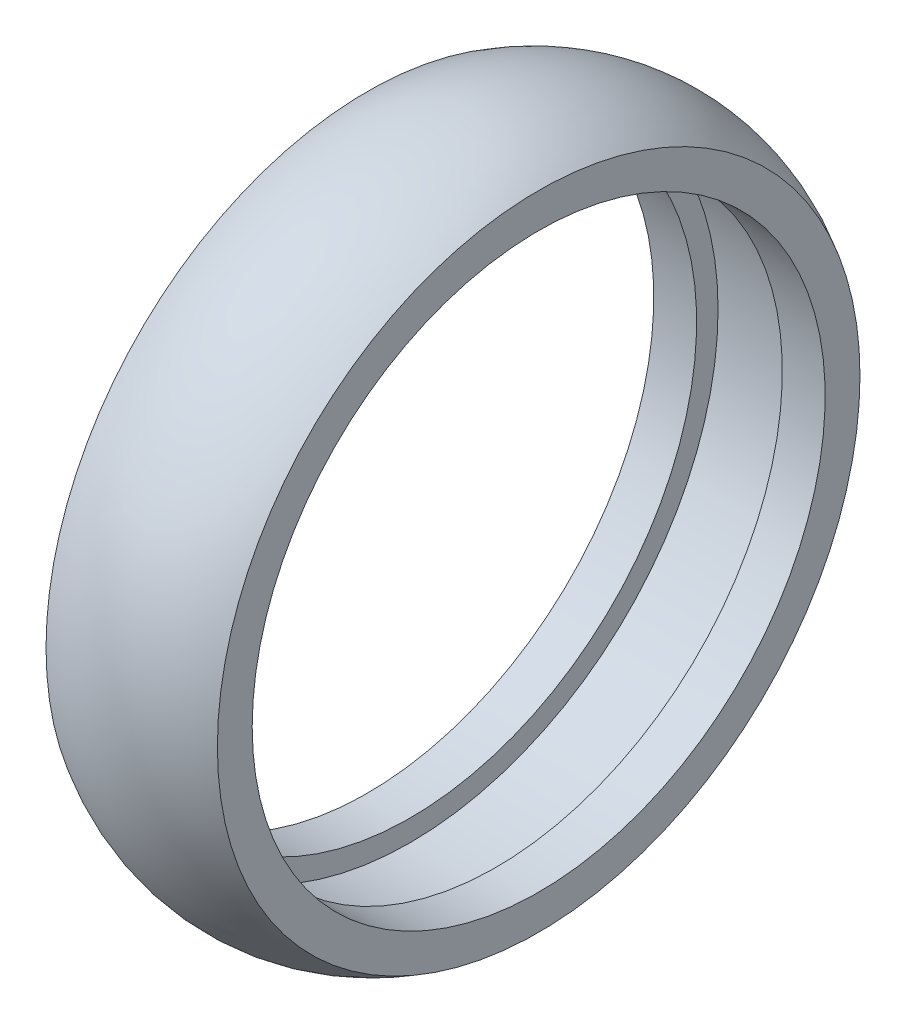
from build123d import *


with BuildPart() as part:
    # Esquisse2 → R_volution1 (revolve)
    with BuildSketch(Plane.XY, mode=Mode.PRIVATE) as r_volution1_sk:
        with BuildLine():
            Line((-8, 30), (-8, 26.75))
            Line((-8, 26.75), (-4, 26.75))
            Line((-4, 26.75), (-4, 28.75))
            Line((-4, 28.75), (4, 28.75))
            Line((4, 28.75), (4, 26.75))
            Line((4, 26.75), (8, 26.75))
            Line((8, 26.75), (8, 30))
            ThreePointArc((8, 30), (0, 32.25), (-8, 30))
        make_face()
    revolve(r_volution1_sk.sketch.rotate(Axis((0, 0, 0), (1, 0, 0)), 90), axis=Axis((0, 0, 0), (1, 0, 0)))


solid = part.part
